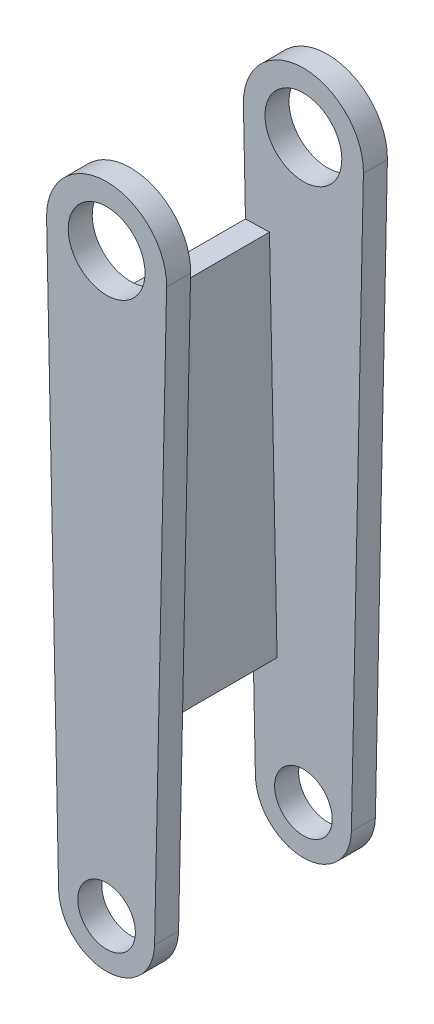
from build123d import *

# Parameters (mm, degrees)
SKETCH1_R           = 6
SKETCH1_R_2         = 8
BOSS_EXTRUDE1_DEPTH = 46
SKETCH2_W           = 36
SKETCH2_H           = 180.360753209
CUT_EXTRUDE1_DEPTH  = 97
SKETCH5_W           = 36
SKETCH5_H           = 76
BOSS_EXTRUDE2_DEPTH = 5


with BuildPart() as part:
    # Sketch1 → Boss-Extrude1 (new body)
    with BuildSketch(Plane.XY):
        with BuildLine():
            Line((-9.997829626, -0.208333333), (-12.497287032, 119.739583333))
            ThreePointArc((-12.497287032, 119.739583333), (0, 132.5), (12.497287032, 119.739583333))
            Line((12.497287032, 119.739583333), (9.997829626, -0.208333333))
            ThreePointArc((9.997829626, -0.208333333), (0, -10), (-9.997829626, -0.208333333))
        make_face()
        Circle(SKETCH1_R, mode=Mode.SUBTRACT)
        with Locations((0, 120)):
            Circle(SKETCH1_R_2, mode=Mode.SUBTRACT)
    extrude(amount=BOSS_EXTRUDE1_DEPTH)

    # Sketch2 → Cut-Extrude1 (cut)
    with BuildSketch(Plane(origin=(9.997829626, -0.208333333, 0), x_dir=(0, 0, 1), z_dir=(-0.9997829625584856, 0.020833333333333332, 0))):
        with Locations((23, 75.371765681)):
            Rectangle(SKETCH2_W, SKETCH2_H)
    extrude(amount=CUT_EXTRUDE1_DEPTH, mode=Mode.SUBTRACT)


with BuildPart() as cut_extrude1_piece_1:
    # of the separate pieces the step leaves, piece 1, a body of its own (cut_extrude1_pieces)
    add(part.part.solids().sort_by_distance((-12.497287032, 119.739583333, 0))[0])



with BuildPart() as cut_extrude1_piece_2:
    # of the separate pieces the step leaves, piece 2, a body of its own (cut_extrude1_pieces)
    add(part.part.solids().sort_by_distance((-12.497287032, 119.739583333, 41))[0])


with BuildPart() as cut_extrude1_piece_1_1:
    add(cut_extrude1_piece_1.part)

    add(cut_extrude1_piece_2.part)  # Boss-Extrude2 merges Cut-Extrude1 piece 2
    # Sketch5 → Boss-Extrude2 (add)
    with BuildSketch(Plane(origin=(-9.997829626, -0.208333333, 0), x_dir=(0, 0, 1), z_dir=(-0.9997829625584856, -0.020833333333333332, 0))):
        with Locations((23, 61.473955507)):
            Rectangle(SKETCH5_W, SKETCH5_H)
    extrude(amount=-BOSS_EXTRUDE2_DEPTH)


solid = cut_extrude1_piece_1_1.part
